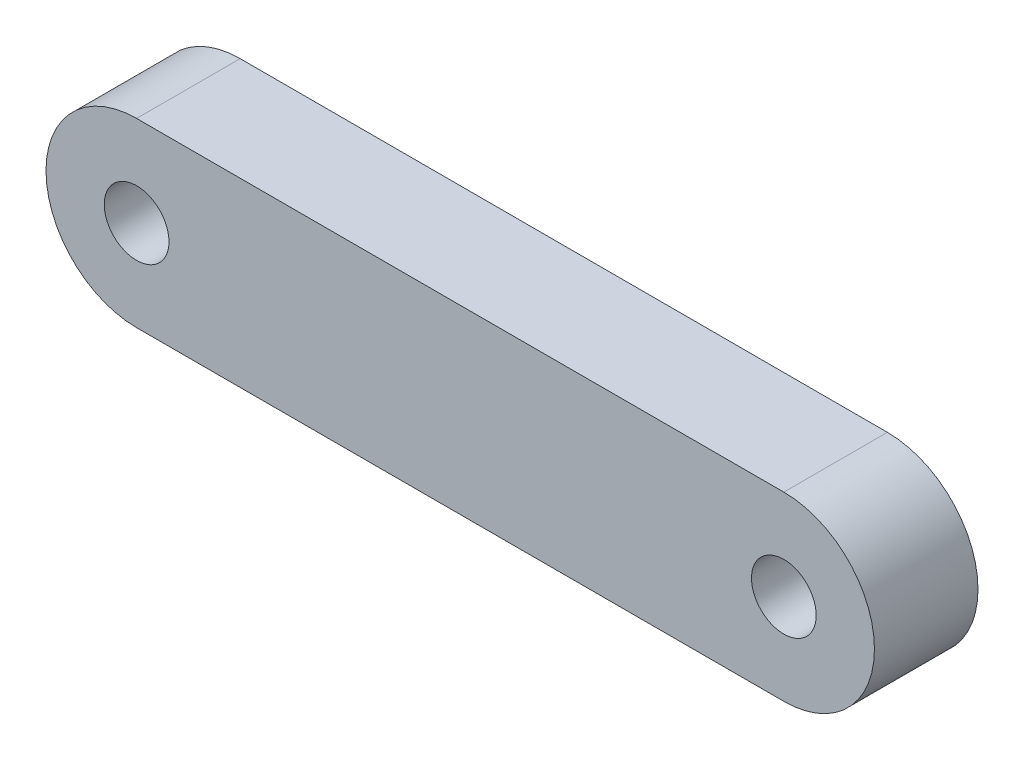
from build123d import *

# Parameters (mm, degrees)
EXTRUDE1_DEPTH     = 5.08
SKETCH2_R          = 1.5875
CUT_EXTRUDE1_DEPTH = 88.533316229


with BuildPart() as part:
    # Sketch1 → Extrude1 (new body)
    with BuildSketch(Plane.XY):
        with BuildLine():
            Line((-44.45, -33.655), (-76.2, -33.655))
            ThreePointArc((-76.2, -33.655), (-80.645, -29.21), (-76.2, -24.765))
            Line((-76.2, -24.765), (-44.45, -24.765))
            ThreePointArc((-44.45, -24.765), (-40.005, -29.21), (-44.45, -33.655))
        make_face()
    extrude(amount=EXTRUDE1_DEPTH)

    # Sketch2 → Cut-Extrude1 (cut, through all)
    with BuildSketch(Plane.XY.offset(5.08)):
        with Locations((-44.45, -29.21)):
            Circle(SKETCH2_R)
        with Locations((-76.2, -29.21)):
            Circle(SKETCH2_R)
    extrude(amount=-CUT_EXTRUDE1_DEPTH, mode=Mode.SUBTRACT)


solid = part.part
